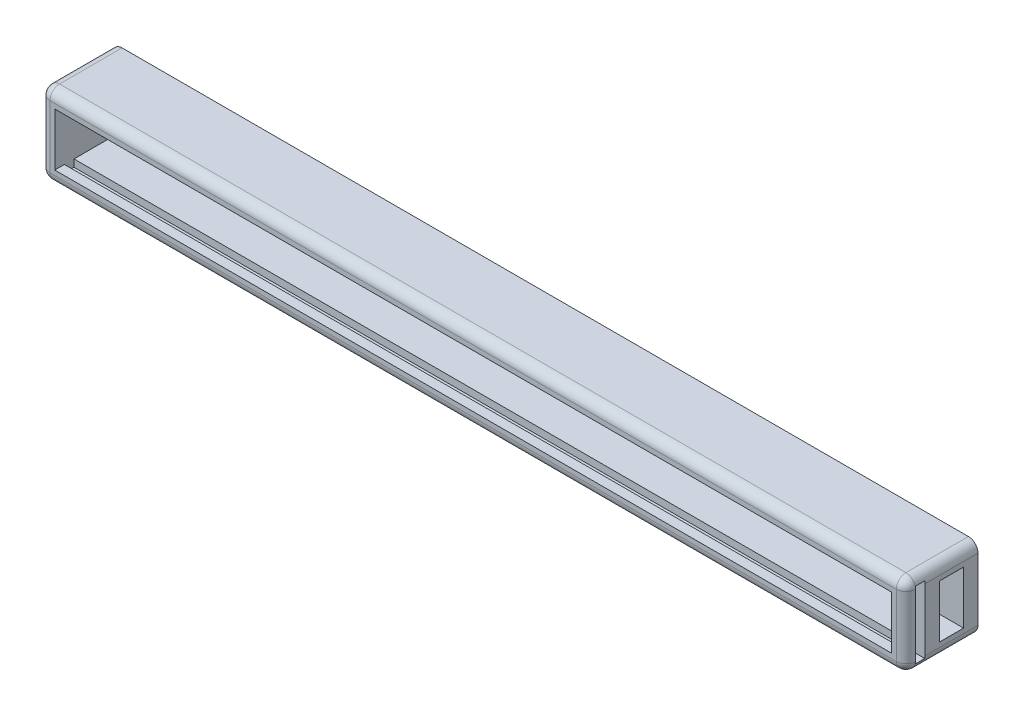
ISO-10303-21;
HEADER;
FILE_DESCRIPTION(('STEP AP214'),'2;1');
FILE_NAME('part.step','',(''),(''),'','','');
FILE_SCHEMA(('AUTOMOTIVE_DESIGN { 1 0 10303 214 1 1 1 1 }'));
ENDSEC;
DATA;
#1=APPLICATION_CONTEXT('core data for automotive mechanical design processes');
#2=APPLICATION_PROTOCOL_DEFINITION('international standard','automotive_design',2000,#1);
#3=PRODUCT_CONTEXT('',#1,'mechanical');
#4=PRODUCT('Part','Part','',(#3));
#5=PRODUCT_RELATED_PRODUCT_CATEGORY('part','',(#4));
#6=PRODUCT_DEFINITION_FORMATION('','',#4);
#7=PRODUCT_DEFINITION_CONTEXT('part definition',#1,'design');
#8=PRODUCT_DEFINITION('design','',#6,#7);
#9=PRODUCT_DEFINITION_SHAPE('','',#8);
#10=(LENGTH_UNIT() NAMED_UNIT(*) SI_UNIT(.MILLI.,.METRE.));
#11=(NAMED_UNIT(*) PLANE_ANGLE_UNIT() SI_UNIT($,.RADIAN.));
#12=(NAMED_UNIT(*) SI_UNIT($,.STERADIAN.) SOLID_ANGLE_UNIT());
#13=UNCERTAINTY_MEASURE_WITH_UNIT(LENGTH_MEASURE(1.E-05),#10,'distance_accuracy_value','');
#14=(GEOMETRIC_REPRESENTATION_CONTEXT(3) GLOBAL_UNCERTAINTY_ASSIGNED_CONTEXT((#13)) GLOBAL_UNIT_ASSIGNED_CONTEXT((#10,
#11,#12)) REPRESENTATION_CONTEXT('',''));
#15=CARTESIAN_POINT('',(0.,0.,0.));
#16=DIRECTION('',(0.,0.,1.));
#17=DIRECTION('',(1.,0.,0.));
#18=AXIS2_PLACEMENT_3D('',#15,#16,#17);
#19=CARTESIAN_POINT('',(90.,-8.49999999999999,15.));
#20=DIRECTION('',(-1.,0.,0.));
#21=DIRECTION('',(0.,0.,1.));
#22=AXIS2_PLACEMENT_3D('',#19,#20,#21);
#23=PLANE('',#22);
#24=DIRECTION('',(0.,0.,1.));
#25=VECTOR('',#24,1.);
#26=CARTESIAN_POINT('',(90.,5.50000000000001,3.));
#27=LINE('',#26,#25);
#28=CARTESIAN_POINT('',(90.,5.50000000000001,3.));
#29=VERTEX_POINT('',#28);
#30=CARTESIAN_POINT('',(90.,5.50000000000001,8.));
#31=VERTEX_POINT('',#30);
#32=EDGE_CURVE('E297',#29,#31,#27,.T.);
#33=ORIENTED_EDGE('',*,*,#32,.F.);
#34=DIRECTION('',(0.,1.,0.));
#35=VECTOR('',#34,1.);
#36=CARTESIAN_POINT('',(90.,-5.49999999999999,3.));
#37=LINE('',#36,#35);
#38=CARTESIAN_POINT('',(90.,-5.49999999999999,3.));
#39=VERTEX_POINT('',#38);
#40=EDGE_CURVE('E293',#39,#29,#37,.T.);
#41=ORIENTED_EDGE('',*,*,#40,.F.);
#42=DIRECTION('',(0.,0.,-1.));
#43=VECTOR('',#42,1.);
#44=CARTESIAN_POINT('',(90.,-5.49999999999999,3.));
#45=LINE('',#44,#43);
#46=CARTESIAN_POINT('',(90.,-5.49999999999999,8.));
#47=VERTEX_POINT('',#46);
#48=EDGE_CURVE('E306',#47,#39,#45,.T.);
#49=ORIENTED_EDGE('',*,*,#48,.F.);
#50=DIRECTION('',(0.,-1.,0.));
#51=VECTOR('',#50,1.);
#52=CARTESIAN_POINT('',(90.,-5.49999999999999,8.));
#53=LINE('',#52,#51);
#54=EDGE_CURVE('E302',#31,#47,#53,.T.);
#55=ORIENTED_EDGE('',*,*,#54,.F.);
#56=EDGE_LOOP('',(#33,#41,#49,#55));
#57=FACE_BOUND('',#56,.T.);
#58=DIRECTION('',(0.,1.,0.));
#59=VECTOR('',#58,1.);
#60=CARTESIAN_POINT('',(90.,6.99999999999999,11.));
#61=LINE('',#60,#59);
#62=CARTESIAN_POINT('',(90.,-6.49999999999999,11.));
#63=VERTEX_POINT('',#62);
#64=CARTESIAN_POINT('',(90.,6.50000000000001,11.));
#65=VERTEX_POINT('',#64);
#66=EDGE_CURVE('E242',#63,#65,#61,.T.);
#67=ORIENTED_EDGE('',*,*,#66,.F.);
#68=DIRECTION('',(0.,0.,-1.));
#69=VECTOR('',#68,1.);
#70=CARTESIAN_POINT('',(90.,-6.49999999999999,15.));
#71=LINE('',#70,#69);
#72=CARTESIAN_POINT('',(90.,-6.49999999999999,0.));
#73=VERTEX_POINT('',#72);
#74=EDGE_CURVE('E56',#63,#73,#71,.T.);
#75=ORIENTED_EDGE('',*,*,#74,.T.);
#76=DIRECTION('',(0.,1.,0.));
#77=VECTOR('',#76,1.);
#78=CARTESIAN_POINT('',(90.,-8.49999999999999,0.));
#79=LINE('',#78,#77);
#80=CARTESIAN_POINT('',(90.,6.50000000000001,0.));
#81=VERTEX_POINT('',#80);
#82=EDGE_CURVE('E358',#73,#81,#79,.T.);
#83=ORIENTED_EDGE('',*,*,#82,.T.);
#84=DIRECTION('',(0.,0.,-1.));
#85=VECTOR('',#84,1.);
#86=CARTESIAN_POINT('',(90.,6.50000000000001,15.));
#87=LINE('',#86,#85);
#88=EDGE_CURVE('E471',#81,#65,#87,.F.);
#89=ORIENTED_EDGE('',*,*,#88,.T.);
#90=EDGE_LOOP('',(#67,#75,#83,#89));
#91=FACE_BOUND('',#90,.T.);
#92=ADVANCED_FACE('F47',(#57,#91),#23,.F.);
#93=CARTESIAN_POINT('',(-87.,-5.49999999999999,24.));
#94=DIRECTION('',(0.,1.,0.));
#95=DIRECTION('',(0.,0.,1.));
#96=AXIS2_PLACEMENT_3D('',#93,#94,#95);
#97=PLANE('',#96);
#98=DIRECTION('',(0.,0.,-1.));
#99=VECTOR('',#98,1.);
#100=CARTESIAN_POINT('',(-87.,-5.49999999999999,24.));
#101=LINE('',#100,#99);
#102=CARTESIAN_POINT('',(-87.,-5.49999999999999,11.));
#103=VERTEX_POINT('',#102);
#104=CARTESIAN_POINT('',(-87.,-5.49999999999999,3.));
#105=VERTEX_POINT('',#104);
#106=EDGE_CURVE('E346',#103,#105,#101,.T.);
#107=ORIENTED_EDGE('',*,*,#106,.F.);
#108=DIRECTION('',(1.,0.,0.));
#109=VECTOR('',#108,1.);
#110=CARTESIAN_POINT('',(-87.,-5.49999999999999,11.));
#111=LINE('',#110,#109);
#112=CARTESIAN_POINT('',(87.,-5.49999999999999,11.));
#113=VERTEX_POINT('',#112);
#114=EDGE_CURVE('E221',#103,#113,#111,.T.);
#115=ORIENTED_EDGE('',*,*,#114,.T.);
#116=DIRECTION('',(0.,0.,-1.));
#117=VECTOR('',#116,1.);
#118=CARTESIAN_POINT('',(87.,-5.49999999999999,24.));
#119=LINE('',#118,#117);
#120=CARTESIAN_POINT('',(87.,-5.49999999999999,8.));
#121=VERTEX_POINT('',#120);
#122=EDGE_CURVE('E341',#113,#121,#119,.T.);
#123=ORIENTED_EDGE('',*,*,#122,.T.);
#124=DIRECTION('',(1.,0.,0.));
#125=VECTOR('',#124,1.);
#126=CARTESIAN_POINT('',(78.,-5.49999999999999,8.));
#127=LINE('',#126,#125);
#128=EDGE_CURVE('E311',#121,#47,#127,.T.);
#129=ORIENTED_EDGE('',*,*,#128,.T.);
#130=ORIENTED_EDGE('',*,*,#48,.T.);
#131=DIRECTION('',(1.,0.,0.));
#132=VECTOR('',#131,1.);
#133=CARTESIAN_POINT('',(-87.,-5.49999999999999,3.));
#134=LINE('',#133,#132);
#135=EDGE_CURVE('E324',#105,#39,#134,.T.);
#136=ORIENTED_EDGE('',*,*,#135,.F.);
#137=EDGE_LOOP('',(#107,#115,#123,#129,#130,#136));
#138=FACE_BOUND('',#137,.T.);
#139=ADVANCED_FACE('F557',(#138),#97,.T.);
#140=CARTESIAN_POINT('',(87.,5.49999999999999,24.));
#141=DIRECTION('',(-1.,0.,0.));
#142=DIRECTION('',(0.,-1.,0.));
#143=AXIS2_PLACEMENT_3D('',#140,#141,#142);
#144=PLANE('',#143);
#145=ORIENTED_EDGE('',*,*,#122,.F.);
#146=DIRECTION('',(0.,1.,0.));
#147=VECTOR('',#146,1.);
#148=CARTESIAN_POINT('',(87.,5.49999999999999,11.));
#149=LINE('',#148,#147);
#150=CARTESIAN_POINT('',(87.,5.49999999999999,11.));
#151=VERTEX_POINT('',#150);
#152=EDGE_CURVE('E284',#113,#151,#149,.T.);
#153=ORIENTED_EDGE('',*,*,#152,.T.);
#154=DIRECTION('',(0.,0.,-1.));
#155=VECTOR('',#154,1.);
#156=CARTESIAN_POINT('',(87.,5.49999999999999,24.));
#157=LINE('',#156,#155);
#158=CARTESIAN_POINT('',(87.,5.49999999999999,8.));
#159=VERTEX_POINT('',#158);
#160=EDGE_CURVE('E336',#151,#159,#157,.T.);
#161=ORIENTED_EDGE('',*,*,#160,.T.);
#162=DIRECTION('',(0.,1.,0.));
#163=VECTOR('',#162,1.);
#164=CARTESIAN_POINT('',(87.,5.49999999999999,8.));
#165=LINE('',#164,#163);
#166=EDGE_CURVE('E314',#121,#159,#165,.T.);
#167=ORIENTED_EDGE('',*,*,#166,.F.);
#168=EDGE_LOOP('',(#145,#153,#161,#167));
#169=FACE_BOUND('',#168,.T.);
#170=ADVANCED_FACE('F574',(#169),#144,.T.);
#171=CARTESIAN_POINT('',(-87.,5.49999999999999,24.));
#172=DIRECTION('',(0.,-1.,0.));
#173=DIRECTION('',(0.,0.,-1.));
#174=AXIS2_PLACEMENT_3D('',#171,#172,#173);
#175=PLANE('',#174);
#176=ORIENTED_EDGE('',*,*,#160,.F.);
#177=DIRECTION('',(-1.,0.,0.));
#178=VECTOR('',#177,1.);
#179=CARTESIAN_POINT('',(-87.,5.49999999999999,11.));
#180=LINE('',#179,#178);
#181=CARTESIAN_POINT('',(-87.,5.49999999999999,11.));
#182=VERTEX_POINT('',#181);
#183=EDGE_CURVE('E281',#151,#182,#180,.T.);
#184=ORIENTED_EDGE('',*,*,#183,.T.);
#185=DIRECTION('',(0.,0.,-1.));
#186=VECTOR('',#185,1.);
#187=CARTESIAN_POINT('',(-87.,5.49999999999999,24.));
#188=LINE('',#187,#186);
#189=CARTESIAN_POINT('',(-87.,5.49999999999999,3.));
#190=VERTEX_POINT('',#189);
#191=EDGE_CURVE('E331',#182,#190,#188,.T.);
#192=ORIENTED_EDGE('',*,*,#191,.T.);
#193=DIRECTION('',(-1.,0.,0.));
#194=VECTOR('',#193,1.);
#195=CARTESIAN_POINT('',(-87.,5.49999999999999,3.));
#196=LINE('',#195,#194);
#197=EDGE_CURVE('E327',#29,#190,#196,.T.);
#198=ORIENTED_EDGE('',*,*,#197,.F.);
#199=ORIENTED_EDGE('',*,*,#32,.T.);
#200=DIRECTION('',(1.,0.,0.));
#201=VECTOR('',#200,1.);
#202=CARTESIAN_POINT('',(78.,5.50000000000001,8.));
#203=LINE('',#202,#201);
#204=EDGE_CURVE('E310',#159,#31,#203,.T.);
#205=ORIENTED_EDGE('',*,*,#204,.F.);
#206=EDGE_LOOP('',(#176,#184,#192,#198,#199,#205));
#207=FACE_BOUND('',#206,.T.);
#208=ADVANCED_FACE('F564',(#207),#175,.T.);
#209=CARTESIAN_POINT('',(88.,-6.49999999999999,15.));
#210=DIRECTION('',(0.,0.,-1.));
#211=DIRECTION('',(-1.,0.,0.));
#212=AXIS2_PLACEMENT_3D('',#209,#210,#211);
#213=CYLINDRICAL_SURFACE('',#212,2.);
#214=CARTESIAN_POINT('',(88.,-6.49999999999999,11.));
#215=DIRECTION('',(0.,0.,1.));
#216=DIRECTION('',(1.,0.,0.));
#217=AXIS2_PLACEMENT_3D('',#214,#215,#216);
#218=CIRCLE('',#217,2.);
#219=CARTESIAN_POINT('',(89.9364916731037,-6.99999999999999,11.));
#220=VERTEX_POINT('',#219);
#221=EDGE_CURVE('E278',#63,#220,#218,.F.);
#222=ORIENTED_EDGE('',*,*,#221,.T.);
#223=DIRECTION('',(0.,0.,-1.));
#224=VECTOR('',#223,1.);
#225=CARTESIAN_POINT('',(89.9364916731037,-6.99999999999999,15.));
#226=LINE('',#225,#224);
#227=CARTESIAN_POINT('',(89.9364916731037,-6.99999999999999,13.));
#228=VERTEX_POINT('',#227);
#229=EDGE_CURVE('E240',#220,#228,#226,.F.);
#230=ORIENTED_EDGE('',*,*,#229,.T.);
#231=CARTESIAN_POINT('',(88.,-6.49999999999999,13.));
#232=DIRECTION('',(0.,0.,1.));
#233=DIRECTION('',(1.,0.,0.));
#234=AXIS2_PLACEMENT_3D('',#231,#232,#233);
#235=CIRCLE('',#234,2.);
#236=CARTESIAN_POINT('',(88.,-8.49999999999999,13.));
#237=VERTEX_POINT('',#236);
#238=EDGE_CURVE('E484',#237,#228,#235,.T.);
#239=ORIENTED_EDGE('',*,*,#238,.F.);
#240=DIRECTION('',(0.,0.,-1.));
#241=VECTOR('',#240,1.);
#242=CARTESIAN_POINT('',(88.,-8.49999999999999,15.));
#243=LINE('',#242,#241);
#244=CARTESIAN_POINT('',(88.,-8.49999999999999,0.));
#245=VERTEX_POINT('',#244);
#246=EDGE_CURVE('E441',#245,#237,#243,.F.);
#247=ORIENTED_EDGE('',*,*,#246,.F.);
#248=CARTESIAN_POINT('',(88.,-6.49999999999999,0.));
#249=DIRECTION('',(0.,0.,1.));
#250=DIRECTION('',(1.,0.,0.));
#251=AXIS2_PLACEMENT_3D('',#248,#249,#250);
#252=CIRCLE('',#251,2.);
#253=EDGE_CURVE('E450',#73,#245,#252,.F.);
#254=ORIENTED_EDGE('',*,*,#253,.F.);
#255=ORIENTED_EDGE('',*,*,#74,.F.);
#256=EDGE_LOOP('',(#222,#230,#239,#247,#254,#255));
#257=FACE_BOUND('',#256,.T.);
#258=ADVANCED_FACE('F537',(#257),#213,.T.);
#259=CARTESIAN_POINT('',(88.,6.50000000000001,15.));
#260=DIRECTION('',(0.,0.,-1.));
#261=DIRECTION('',(-1.,0.,0.));
#262=AXIS2_PLACEMENT_3D('',#259,#260,#261);
#263=CYLINDRICAL_SURFACE('',#262,2.);
#264=CARTESIAN_POINT('',(88.,6.50000000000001,13.));
#265=DIRECTION('',(0.,0.,1.));
#266=DIRECTION('',(1.,0.,0.));
#267=AXIS2_PLACEMENT_3D('',#264,#265,#266);
#268=CIRCLE('',#267,2.);
#269=CARTESIAN_POINT('',(89.9364916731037,6.99999999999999,13.));
#270=VERTEX_POINT('',#269);
#271=CARTESIAN_POINT('',(88.,8.50000000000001,13.));
#272=VERTEX_POINT('',#271);
#273=EDGE_CURVE('E292',#270,#272,#268,.T.);
#274=ORIENTED_EDGE('',*,*,#273,.F.);
#275=DIRECTION('',(0.,0.,-1.));
#276=VECTOR('',#275,1.);
#277=CARTESIAN_POINT('',(89.9364916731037,6.99999999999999,15.));
#278=LINE('',#277,#276);
#279=CARTESIAN_POINT('',(89.9364916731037,6.99999999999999,11.));
#280=VERTEX_POINT('',#279);
#281=EDGE_CURVE('E274',#270,#280,#278,.T.);
#282=ORIENTED_EDGE('',*,*,#281,.T.);
#283=CARTESIAN_POINT('',(88.,6.50000000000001,11.));
#284=DIRECTION('',(0.,0.,1.));
#285=DIRECTION('',(1.,0.,0.));
#286=AXIS2_PLACEMENT_3D('',#283,#284,#285);
#287=CIRCLE('',#286,2.);
#288=EDGE_CURVE('E11',#280,#65,#287,.F.);
#289=ORIENTED_EDGE('',*,*,#288,.T.);
#290=ORIENTED_EDGE('',*,*,#88,.F.);
#291=CARTESIAN_POINT('',(88.,6.50000000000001,0.));
#292=DIRECTION('',(0.,0.,1.));
#293=DIRECTION('',(1.,0.,0.));
#294=AXIS2_PLACEMENT_3D('',#291,#292,#293);
#295=CIRCLE('',#294,2.);
#296=CARTESIAN_POINT('',(88.,8.50000000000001,0.));
#297=VERTEX_POINT('',#296);
#298=EDGE_CURVE('E447',#297,#81,#295,.F.);
#299=ORIENTED_EDGE('',*,*,#298,.F.);
#300=DIRECTION('',(0.,0.,-1.));
#301=VECTOR('',#300,1.);
#302=CARTESIAN_POINT('',(88.,8.50000000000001,15.));
#303=LINE('',#302,#301);
#304=EDGE_CURVE('E465',#272,#297,#303,.T.);
#305=ORIENTED_EDGE('',*,*,#304,.F.);
#306=EDGE_LOOP('',(#274,#282,#289,#290,#299,#305));
#307=FACE_BOUND('',#306,.T.);
#308=ADVANCED_FACE('F49',(#307),#263,.T.);
#309=CARTESIAN_POINT('',(0.,0.,15.));
#310=DIRECTION('',(0.,0.,1.));
#311=DIRECTION('',(1.,0.,0.));
#312=AXIS2_PLACEMENT_3D('',#309,#310,#311);
#313=PLANE('',#312);
#314=DIRECTION('',(0.,1.,0.));
#315=VECTOR('',#314,1.);
#316=CARTESIAN_POINT('',(88.,8.50000000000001,15.));
#317=LINE('',#316,#315);
#318=CARTESIAN_POINT('',(88.,-6.49999999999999,15.));
#319=VERTEX_POINT('',#318);
#320=CARTESIAN_POINT('',(88.,6.50000000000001,15.));
#321=VERTEX_POINT('',#320);
#322=EDGE_CURVE('E374',#319,#321,#317,.T.);
#323=ORIENTED_EDGE('',*,*,#322,.T.);
#324=DIRECTION('',(-1.,0.,0.));
#325=VECTOR('',#324,1.);
#326=CARTESIAN_POINT('',(-90.,6.49999999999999,15.));
#327=LINE('',#326,#325);
#328=CARTESIAN_POINT('',(-88.,6.49999999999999,15.));
#329=VERTEX_POINT('',#328);
#330=EDGE_CURVE('E378',#321,#329,#327,.T.);
#331=ORIENTED_EDGE('',*,*,#330,.T.);
#332=DIRECTION('',(0.,-1.,0.));
#333=VECTOR('',#332,1.);
#334=CARTESIAN_POINT('',(-88.,-8.50000000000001,15.));
#335=LINE('',#334,#333);
#336=CARTESIAN_POINT('',(-88.,-6.50000000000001,15.));
#337=VERTEX_POINT('',#336);
#338=EDGE_CURVE('E366',#329,#337,#335,.T.);
#339=ORIENTED_EDGE('',*,*,#338,.T.);
#340=DIRECTION('',(1.,0.,0.));
#341=VECTOR('',#340,1.);
#342=CARTESIAN_POINT('',(90.,-6.49999999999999,15.));
#343=LINE('',#342,#341);
#344=EDGE_CURVE('E370',#337,#319,#343,.T.);
#345=ORIENTED_EDGE('',*,*,#344,.T.);
#346=EDGE_LOOP('',(#323,#331,#339,#345));
#347=FACE_BOUND('',#346,.T.);
#348=DIRECTION('',(-1.,0.,0.));
#349=VECTOR('',#348,1.);
#350=CARTESIAN_POINT('',(0.,-5.49999999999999,15.));
#351=LINE('',#350,#349);
#352=CARTESIAN_POINT('',(87.,-5.49999999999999,15.));
#353=VERTEX_POINT('',#352);
#354=CARTESIAN_POINT('',(-87.,-5.49999999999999,15.));
#355=VERTEX_POINT('',#354);
#356=EDGE_CURVE('E405',#353,#355,#351,.T.);
#357=ORIENTED_EDGE('',*,*,#356,.T.);
#358=DIRECTION('',(0.,1.,0.));
#359=VECTOR('',#358,1.);
#360=CARTESIAN_POINT('',(-87.,0.,15.));
#361=LINE('',#360,#359);
#362=CARTESIAN_POINT('',(-87.,5.49999999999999,15.));
#363=VERTEX_POINT('',#362);
#364=EDGE_CURVE('E409',#355,#363,#361,.T.);
#365=ORIENTED_EDGE('',*,*,#364,.T.);
#366=DIRECTION('',(1.,0.,0.));
#367=VECTOR('',#366,1.);
#368=CARTESIAN_POINT('',(0.,5.49999999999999,15.));
#369=LINE('',#368,#367);
#370=CARTESIAN_POINT('',(87.,5.49999999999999,15.));
#371=VERTEX_POINT('',#370);
#372=EDGE_CURVE('E397',#363,#371,#369,.T.);
#373=ORIENTED_EDGE('',*,*,#372,.T.);
#374=DIRECTION('',(0.,-1.,0.));
#375=VECTOR('',#374,1.);
#376=CARTESIAN_POINT('',(87.,-2.19521370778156E-13,15.));
#377=LINE('',#376,#375);
#378=EDGE_CURVE('E401',#371,#353,#377,.T.);
#379=ORIENTED_EDGE('',*,*,#378,.T.);
#380=EDGE_LOOP('',(#357,#365,#373,#379));
#381=FACE_BOUND('',#380,.T.);
#382=ADVANCED_FACE('F523',(#347,#381),#313,.T.);
#383=CARTESIAN_POINT('',(-90.,-8.50000000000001,15.));
#384=DIRECTION('',(1.,0.,0.));
#385=DIRECTION('',(0.,1.,0.));
#386=AXIS2_PLACEMENT_3D('',#383,#384,#385);
#387=PLANE('',#386);
#388=DIRECTION('',(0.,-1.,0.));
#389=VECTOR('',#388,1.);
#390=CARTESIAN_POINT('',(-90.,-8.50000000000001,0.));
#391=LINE('',#390,#389);
#392=CARTESIAN_POINT('',(-90.,6.49999999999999,0.));
#393=VERTEX_POINT('',#392);
#394=CARTESIAN_POINT('',(-90.,-6.50000000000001,0.));
#395=VERTEX_POINT('',#394);
#396=EDGE_CURVE('E350',#393,#395,#391,.T.);
#397=ORIENTED_EDGE('',*,*,#396,.T.);
#398=DIRECTION('',(0.,0.,-1.));
#399=VECTOR('',#398,1.);
#400=CARTESIAN_POINT('',(-90.,-6.50000000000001,15.));
#401=LINE('',#400,#399);
#402=CARTESIAN_POINT('',(-90.,-6.50000000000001,13.));
#403=VERTEX_POINT('',#402);
#404=EDGE_CURVE('E462',#395,#403,#401,.F.);
#405=ORIENTED_EDGE('',*,*,#404,.T.);
#406=DIRECTION('',(0.,-1.,0.));
#407=VECTOR('',#406,1.);
#408=CARTESIAN_POINT('',(-90.,8.49999999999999,13.));
#409=LINE('',#408,#407);
#410=CARTESIAN_POINT('',(-90.,6.49999999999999,13.));
#411=VERTEX_POINT('',#410);
#412=EDGE_CURVE('E393',#403,#411,#409,.F.);
#413=ORIENTED_EDGE('',*,*,#412,.T.);
#414=DIRECTION('',(0.,0.,-1.));
#415=VECTOR('',#414,1.);
#416=CARTESIAN_POINT('',(-90.,6.49999999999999,15.));
#417=LINE('',#416,#415);
#418=EDGE_CURVE('E459',#411,#393,#417,.T.);
#419=ORIENTED_EDGE('',*,*,#418,.T.);
#420=EDGE_LOOP('',(#397,#405,#413,#419));
#421=FACE_BOUND('',#420,.T.);
#422=ADVANCED_FACE('F599',(#421),#387,.F.);
#423=CARTESIAN_POINT('',(90.,-8.49999999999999,15.));
#424=DIRECTION('',(0.,1.,0.));
#425=DIRECTION('',(-1.,0.,0.));
#426=AXIS2_PLACEMENT_3D('',#423,#424,#425);
#427=PLANE('',#426);
#428=DIRECTION('',(1.,0.,0.));
#429=VECTOR('',#428,1.);
#430=CARTESIAN_POINT('',(-90.,-8.50000000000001,13.));
#431=LINE('',#430,#429);
#432=CARTESIAN_POINT('',(-88.,-8.50000000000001,13.));
#433=VERTEX_POINT('',#432);
#434=EDGE_CURVE('E389',#237,#433,#431,.F.);
#435=ORIENTED_EDGE('',*,*,#434,.T.);
#436=DIRECTION('',(0.,0.,-1.));
#437=VECTOR('',#436,1.);
#438=CARTESIAN_POINT('',(-88.,-8.50000000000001,15.));
#439=LINE('',#438,#437);
#440=CARTESIAN_POINT('',(-87.9999999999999,-8.50000000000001,0.));
#441=VERTEX_POINT('',#440);
#442=EDGE_CURVE('E444',#433,#441,#439,.T.);
#443=ORIENTED_EDGE('',*,*,#442,.T.);
#444=DIRECTION('',(1.,0.,0.));
#445=VECTOR('',#444,1.);
#446=CARTESIAN_POINT('',(90.,-8.49999999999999,0.));
#447=LINE('',#446,#445);
#448=EDGE_CURVE('E354',#441,#245,#447,.T.);
#449=ORIENTED_EDGE('',*,*,#448,.T.);
#450=ORIENTED_EDGE('',*,*,#246,.T.);
#451=EDGE_LOOP('',(#435,#443,#449,#450));
#452=FACE_BOUND('',#451,.T.);
#453=ADVANCED_FACE('F596',(#452),#427,.F.);
#454=CARTESIAN_POINT('',(90.,8.50000000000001,15.));
#455=DIRECTION('',(0.,-1.,0.));
#456=DIRECTION('',(1.,0.,0.));
#457=AXIS2_PLACEMENT_3D('',#454,#455,#456);
#458=PLANE('',#457);
#459=DIRECTION('',(-1.,0.,0.));
#460=VECTOR('',#459,1.);
#461=CARTESIAN_POINT('',(90.,8.50000000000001,0.));
#462=LINE('',#461,#460);
#463=CARTESIAN_POINT('',(-87.9999999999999,8.49999999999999,0.));
#464=VERTEX_POINT('',#463);
#465=EDGE_CURVE('E362',#297,#464,#462,.T.);
#466=ORIENTED_EDGE('',*,*,#465,.T.);
#467=DIRECTION('',(0.,0.,-1.));
#468=VECTOR('',#467,1.);
#469=CARTESIAN_POINT('',(-88.,8.49999999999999,15.));
#470=LINE('',#469,#468);
#471=CARTESIAN_POINT('',(-88.,8.49999999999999,13.));
#472=VERTEX_POINT('',#471);
#473=EDGE_CURVE('E468',#464,#472,#470,.F.);
#474=ORIENTED_EDGE('',*,*,#473,.T.);
#475=DIRECTION('',(-1.,0.,0.));
#476=VECTOR('',#475,1.);
#477=CARTESIAN_POINT('',(90.,8.50000000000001,13.));
#478=LINE('',#477,#476);
#479=EDGE_CURVE('E382',#472,#272,#478,.F.);
#480=ORIENTED_EDGE('',*,*,#479,.T.);
#481=ORIENTED_EDGE('',*,*,#304,.T.);
#482=EDGE_LOOP('',(#466,#474,#480,#481));
#483=FACE_BOUND('',#482,.T.);
#484=ADVANCED_FACE('F507',(#483),#458,.F.);
#485=CARTESIAN_POINT('',(0.,0.,0.));
#486=DIRECTION('',(0.,0.,1.));
#487=DIRECTION('',(1.,0.,0.));
#488=AXIS2_PLACEMENT_3D('',#485,#486,#487);
#489=PLANE('',#488);
#490=ORIENTED_EDGE('',*,*,#448,.F.);
#491=CARTESIAN_POINT('',(-88.,-6.50000000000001,0.));
#492=DIRECTION('',(0.,0.,1.));
#493=DIRECTION('',(1.,0.,0.));
#494=AXIS2_PLACEMENT_3D('',#491,#492,#493);
#495=CIRCLE('',#494,2.);
#496=EDGE_CURVE('E456',#441,#395,#495,.F.);
#497=ORIENTED_EDGE('',*,*,#496,.T.);
#498=ORIENTED_EDGE('',*,*,#396,.F.);
#499=CARTESIAN_POINT('',(-88.,6.49999999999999,0.));
#500=DIRECTION('',(0.,0.,1.));
#501=DIRECTION('',(1.,0.,0.));
#502=AXIS2_PLACEMENT_3D('',#499,#500,#501);
#503=CIRCLE('',#502,2.);
#504=EDGE_CURVE('E453',#393,#464,#503,.F.);
#505=ORIENTED_EDGE('',*,*,#504,.T.);
#506=ORIENTED_EDGE('',*,*,#465,.F.);
#507=ORIENTED_EDGE('',*,*,#298,.T.);
#508=ORIENTED_EDGE('',*,*,#82,.F.);
#509=ORIENTED_EDGE('',*,*,#253,.T.);
#510=EDGE_LOOP('',(#490,#497,#498,#505,#506,#507,#508,#509));
#511=FACE_BOUND('',#510,.T.);
#512=ADVANCED_FACE('F613',(#511),#489,.F.);
#513=CARTESIAN_POINT('',(0.,-6.5,13.));
#514=DIRECTION('',(-1.,0.,0.));
#515=DIRECTION('',(0.,-1.,0.));
#516=AXIS2_PLACEMENT_3D('',#513,#514,#515);
#517=CYLINDRICAL_SURFACE('',#516,2.);
#518=ORIENTED_EDGE('',*,*,#344,.F.);
#519=CARTESIAN_POINT('',(-88.,-6.50000000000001,13.));
#520=DIRECTION('',(-1.,0.,0.));
#521=DIRECTION('',(0.,-1.,0.));
#522=AXIS2_PLACEMENT_3D('',#519,#520,#521);
#523=CIRCLE('',#522,2.);
#524=EDGE_CURVE('E423',#337,#433,#523,.F.);
#525=ORIENTED_EDGE('',*,*,#524,.T.);
#526=ORIENTED_EDGE('',*,*,#434,.F.);
#527=CARTESIAN_POINT('',(88.,-6.49999999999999,13.));
#528=DIRECTION('',(-1.,0.,0.));
#529=DIRECTION('',(0.,-1.,0.));
#530=AXIS2_PLACEMENT_3D('',#527,#528,#529);
#531=CIRCLE('',#530,2.);
#532=EDGE_CURVE('E420',#237,#319,#531,.T.);
#533=ORIENTED_EDGE('',*,*,#532,.T.);
#534=EDGE_LOOP('',(#518,#525,#526,#533));
#535=FACE_BOUND('',#534,.T.);
#536=ADVANCED_FACE('F610',(#535),#517,.T.);
#537=CARTESIAN_POINT('',(88.,0.,13.));
#538=DIRECTION('',(0.,-1.,0.));
#539=DIRECTION('',(0.,0.,-1.));
#540=AXIS2_PLACEMENT_3D('',#537,#538,#539);
#541=CYLINDRICAL_SURFACE('',#540,2.);
#542=ORIENTED_EDGE('',*,*,#322,.F.);
#543=CARTESIAN_POINT('',(88.,-6.49999999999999,13.));
#544=DIRECTION('',(0.,-1.,0.));
#545=DIRECTION('',(0.,0.,-1.));
#546=AXIS2_PLACEMENT_3D('',#543,#544,#545);
#547=CIRCLE('',#546,2.);
#548=CARTESIAN_POINT('',(90.,-6.49999999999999,13.));
#549=VERTEX_POINT('',#548);
#550=EDGE_CURVE('E437',#319,#549,#547,.F.);
#551=ORIENTED_EDGE('',*,*,#550,.T.);
#552=DIRECTION('',(0.,1.,0.));
#553=VECTOR('',#552,1.);
#554=CARTESIAN_POINT('',(90.,-8.49999999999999,13.));
#555=LINE('',#554,#553);
#556=CARTESIAN_POINT('',(90.,6.50000000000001,13.));
#557=VERTEX_POINT('',#556);
#558=EDGE_CURVE('E386',#557,#549,#555,.F.);
#559=ORIENTED_EDGE('',*,*,#558,.F.);
#560=CARTESIAN_POINT('',(88.,6.50000000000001,13.));
#561=DIRECTION('',(0.,-1.,0.));
#562=DIRECTION('',(0.,0.,-1.));
#563=AXIS2_PLACEMENT_3D('',#560,#561,#562);
#564=CIRCLE('',#563,2.);
#565=EDGE_CURVE('E434',#557,#321,#564,.T.);
#566=ORIENTED_EDGE('',*,*,#565,.T.);
#567=EDGE_LOOP('',(#542,#551,#559,#566));
#568=FACE_BOUND('',#567,.T.);
#569=ADVANCED_FACE('F528',(#568),#541,.T.);
#570=CARTESIAN_POINT('',(-88.,0.,13.));
#571=DIRECTION('',(0.,1.,0.));
#572=DIRECTION('',(-1.,0.,0.));
#573=AXIS2_PLACEMENT_3D('',#570,#571,#572);
#574=CYLINDRICAL_SURFACE('',#573,2.);
#575=ORIENTED_EDGE('',*,*,#412,.F.);
#576=CARTESIAN_POINT('',(-88.,-6.50000000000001,13.));
#577=DIRECTION('',(0.,1.,0.));
#578=DIRECTION('',(-1.,0.,0.));
#579=AXIS2_PLACEMENT_3D('',#576,#577,#578);
#580=CIRCLE('',#579,2.);
#581=EDGE_CURVE('E416',#403,#337,#580,.T.);
#582=ORIENTED_EDGE('',*,*,#581,.T.);
#583=ORIENTED_EDGE('',*,*,#338,.F.);
#584=CARTESIAN_POINT('',(-88.,6.49999999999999,13.));
#585=DIRECTION('',(0.,1.,0.));
#586=DIRECTION('',(-1.,0.,0.));
#587=AXIS2_PLACEMENT_3D('',#584,#585,#586);
#588=CIRCLE('',#587,2.);
#589=EDGE_CURVE('E413',#329,#411,#588,.F.);
#590=ORIENTED_EDGE('',*,*,#589,.T.);
#591=EDGE_LOOP('',(#575,#582,#583,#590));
#592=FACE_BOUND('',#591,.T.);
#593=ADVANCED_FACE('F519',(#592),#574,.T.);
#594=CARTESIAN_POINT('',(0.,6.5,13.));
#595=DIRECTION('',(1.,0.,0.));
#596=DIRECTION('',(0.,1.,0.));
#597=AXIS2_PLACEMENT_3D('',#594,#595,#596);
#598=CYLINDRICAL_SURFACE('',#597,2.);
#599=ORIENTED_EDGE('',*,*,#479,.F.);
#600=CARTESIAN_POINT('',(-88.,6.49999999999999,13.));
#601=DIRECTION('',(1.,0.,0.));
#602=DIRECTION('',(0.,1.,0.));
#603=AXIS2_PLACEMENT_3D('',#600,#601,#602);
#604=CIRCLE('',#603,2.);
#605=EDGE_CURVE('E430',#472,#329,#604,.T.);
#606=ORIENTED_EDGE('',*,*,#605,.T.);
#607=ORIENTED_EDGE('',*,*,#330,.F.);
#608=CARTESIAN_POINT('',(88.,6.50000000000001,13.));
#609=DIRECTION('',(1.,0.,0.));
#610=DIRECTION('',(0.,1.,0.));
#611=AXIS2_PLACEMENT_3D('',#608,#609,#610);
#612=CIRCLE('',#611,2.);
#613=EDGE_CURVE('E426',#321,#272,#612,.F.);
#614=ORIENTED_EDGE('',*,*,#613,.T.);
#615=EDGE_LOOP('',(#599,#606,#607,#614));
#616=FACE_BOUND('',#615,.T.);
#617=ADVANCED_FACE('F505',(#616),#598,.T.);
#618=CARTESIAN_POINT('',(-87.,5.49999999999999,24.));
#619=DIRECTION('',(1.,0.,0.));
#620=DIRECTION('',(0.,0.,-1.));
#621=AXIS2_PLACEMENT_3D('',#618,#619,#620);
#622=PLANE('',#621);
#623=CARTESIAN_POINT('',(-87.,-5.49999999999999,13.));
#624=VERTEX_POINT('',#623);
#625=EDGE_CURVE('E347',#355,#624,#101,.T.);
#626=ORIENTED_EDGE('',*,*,#625,.T.);
#627=DIRECTION('',(0.,-1.,0.));
#628=VECTOR('',#627,1.);
#629=CARTESIAN_POINT('',(-87.,6.99999999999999,13.));
#630=LINE('',#629,#628);
#631=CARTESIAN_POINT('',(-87.,-6.99999999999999,13.));
#632=VERTEX_POINT('',#631);
#633=EDGE_CURVE('E230',#624,#632,#630,.T.);
#634=ORIENTED_EDGE('',*,*,#633,.T.);
#635=DIRECTION('',(0.,0.,-1.));
#636=VECTOR('',#635,1.);
#637=CARTESIAN_POINT('',(-87.,-6.99999999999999,13.));
#638=LINE('',#637,#636);
#639=CARTESIAN_POINT('',(-87.,-6.99999999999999,11.));
#640=VERTEX_POINT('',#639);
#641=EDGE_CURVE('E227',#632,#640,#638,.T.);
#642=ORIENTED_EDGE('',*,*,#641,.T.);
#643=DIRECTION('',(0.,-1.,0.));
#644=VECTOR('',#643,1.);
#645=CARTESIAN_POINT('',(-87.,6.99999999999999,11.));
#646=LINE('',#645,#644);
#647=EDGE_CURVE('E214',#103,#640,#646,.T.);
#648=ORIENTED_EDGE('',*,*,#647,.F.);
#649=ORIENTED_EDGE('',*,*,#106,.T.);
#650=DIRECTION('',(0.,-1.,0.));
#651=VECTOR('',#650,1.);
#652=CARTESIAN_POINT('',(-87.,5.49999999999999,3.));
#653=LINE('',#652,#651);
#654=EDGE_CURVE('E320',#190,#105,#653,.T.);
#655=ORIENTED_EDGE('',*,*,#654,.F.);
#656=ORIENTED_EDGE('',*,*,#191,.F.);
#657=CARTESIAN_POINT('',(-87.,6.99999999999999,11.));
#658=VERTEX_POINT('',#657);
#659=EDGE_CURVE('E63',#658,#182,#646,.T.);
#660=ORIENTED_EDGE('',*,*,#659,.F.);
#661=DIRECTION('',(0.,0.,-1.));
#662=VECTOR('',#661,1.);
#663=CARTESIAN_POINT('',(-87.,6.99999999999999,13.));
#664=LINE('',#663,#662);
#665=CARTESIAN_POINT('',(-87.,6.99999999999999,13.));
#666=VERTEX_POINT('',#665);
#667=EDGE_CURVE('E236',#666,#658,#664,.T.);
#668=ORIENTED_EDGE('',*,*,#667,.F.);
#669=CARTESIAN_POINT('',(-87.,5.49999999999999,13.));
#670=VERTEX_POINT('',#669);
#671=EDGE_CURVE('E251',#666,#670,#630,.T.);
#672=ORIENTED_EDGE('',*,*,#671,.T.);
#673=EDGE_CURVE('E332',#363,#670,#188,.T.);
#674=ORIENTED_EDGE('',*,*,#673,.F.);
#675=ORIENTED_EDGE('',*,*,#364,.F.);
#676=EDGE_LOOP('',(#626,#634,#642,#648,#649,#655,#656,#660,#668,#672,#674,#675));
#677=FACE_BOUND('',#676,.T.);
#678=ADVANCED_FACE('F229',(#677),#622,.T.);
#679=DIRECTION('',(1.,0.,0.));
#680=VECTOR('',#679,1.);
#681=CARTESIAN_POINT('',(-87.,-5.49999999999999,13.));
#682=LINE('',#681,#680);
#683=CARTESIAN_POINT('',(87.,-5.49999999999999,13.));
#684=VERTEX_POINT('',#683);
#685=EDGE_CURVE('E271',#624,#684,#682,.T.);
#686=ORIENTED_EDGE('',*,*,#685,.F.);
#687=ORIENTED_EDGE('',*,*,#625,.F.);
#688=ORIENTED_EDGE('',*,*,#356,.F.);
#689=EDGE_CURVE('E342',#353,#684,#119,.T.);
#690=ORIENTED_EDGE('',*,*,#689,.T.);
#691=EDGE_LOOP('',(#686,#687,#688,#690));
#692=FACE_BOUND('',#691,.T.);
#693=ADVANCED_FACE('F585',(#692),#97,.T.);
#694=DIRECTION('',(0.,1.,0.));
#695=VECTOR('',#694,1.);
#696=CARTESIAN_POINT('',(87.,5.49999999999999,13.));
#697=LINE('',#696,#695);
#698=CARTESIAN_POINT('',(87.,5.49999999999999,13.));
#699=VERTEX_POINT('',#698);
#700=EDGE_CURVE('E268',#684,#699,#697,.T.);
#701=ORIENTED_EDGE('',*,*,#700,.F.);
#702=ORIENTED_EDGE('',*,*,#689,.F.);
#703=ORIENTED_EDGE('',*,*,#378,.F.);
#704=EDGE_CURVE('E337',#371,#699,#157,.T.);
#705=ORIENTED_EDGE('',*,*,#704,.T.);
#706=EDGE_LOOP('',(#701,#702,#703,#705));
#707=FACE_BOUND('',#706,.T.);
#708=ADVANCED_FACE('F577',(#707),#144,.T.);
#709=DIRECTION('',(-1.,0.,0.));
#710=VECTOR('',#709,1.);
#711=CARTESIAN_POINT('',(-87.,5.49999999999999,13.));
#712=LINE('',#711,#710);
#713=EDGE_CURVE('E265',#699,#670,#712,.T.);
#714=ORIENTED_EDGE('',*,*,#713,.F.);
#715=ORIENTED_EDGE('',*,*,#704,.F.);
#716=ORIENTED_EDGE('',*,*,#372,.F.);
#717=ORIENTED_EDGE('',*,*,#673,.T.);
#718=EDGE_LOOP('',(#714,#715,#716,#717));
#719=FACE_BOUND('',#718,.T.);
#720=ADVANCED_FACE('F583',(#719),#175,.T.);
#721=CARTESIAN_POINT('',(0.,0.,3.));
#722=DIRECTION('',(0.,0.,1.));
#723=DIRECTION('',(1.,0.,0.));
#724=AXIS2_PLACEMENT_3D('',#721,#722,#723);
#725=PLANE('',#724);
#726=ORIENTED_EDGE('',*,*,#197,.T.);
#727=ORIENTED_EDGE('',*,*,#654,.T.);
#728=ORIENTED_EDGE('',*,*,#135,.T.);
#729=ORIENTED_EDGE('',*,*,#40,.T.);
#730=EDGE_LOOP('',(#726,#727,#728,#729));
#731=FACE_BOUND('',#730,.T.);
#732=ADVANCED_FACE('F561',(#731),#725,.T.);
#733=CARTESIAN_POINT('',(78.,-5.49999999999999,8.));
#734=DIRECTION('',(0.,0.,1.));
#735=DIRECTION('',(1.,0.,0.));
#736=AXIS2_PLACEMENT_3D('',#733,#734,#735);
#737=PLANE('',#736);
#738=ORIENTED_EDGE('',*,*,#166,.T.);
#739=ORIENTED_EDGE('',*,*,#204,.T.);
#740=ORIENTED_EDGE('',*,*,#54,.T.);
#741=ORIENTED_EDGE('',*,*,#128,.F.);
#742=EDGE_LOOP('',(#738,#739,#740,#741));
#743=FACE_BOUND('',#742,.T.);
#744=ADVANCED_FACE('F570',(#743),#737,.F.);
#745=CARTESIAN_POINT('',(-88.,-6.50000000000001,15.));
#746=DIRECTION('',(0.,0.,-1.));
#747=DIRECTION('',(-1.,0.,0.));
#748=AXIS2_PLACEMENT_3D('',#745,#746,#747);
#749=CYLINDRICAL_SURFACE('',#748,2.);
#750=ORIENTED_EDGE('',*,*,#496,.F.);
#751=ORIENTED_EDGE('',*,*,#442,.F.);
#752=CARTESIAN_POINT('',(-88.,-6.50000000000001,13.));
#753=DIRECTION('',(0.,0.,1.));
#754=DIRECTION('',(1.,0.,0.));
#755=AXIS2_PLACEMENT_3D('',#752,#753,#754);
#756=CIRCLE('',#755,2.);
#757=EDGE_CURVE('E298',#403,#433,#756,.T.);
#758=ORIENTED_EDGE('',*,*,#757,.F.);
#759=ORIENTED_EDGE('',*,*,#404,.F.);
#760=EDGE_LOOP('',(#750,#751,#758,#759));
#761=FACE_BOUND('',#760,.T.);
#762=ADVANCED_FACE('F618',(#761),#749,.T.);
#763=CARTESIAN_POINT('',(-88.,-6.50000000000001,13.));
#764=DIRECTION('',(0.,0.,1.));
#765=DIRECTION('',(1.,0.,0.));
#766=AXIS2_PLACEMENT_3D('',#763,#764,#765);
#767=SPHERICAL_SURFACE('',#766,2.);
#768=ORIENTED_EDGE('',*,*,#757,.T.);
#769=ORIENTED_EDGE('',*,*,#524,.F.);
#770=ORIENTED_EDGE('',*,*,#581,.F.);
#771=EDGE_LOOP('',(#768,#769,#770));
#772=FACE_BOUND('',#771,.T.);
#773=ADVANCED_FACE('F615',(#772),#767,.T.);
#774=CARTESIAN_POINT('',(-88.,6.49999999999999,15.));
#775=DIRECTION('',(0.,0.,-1.));
#776=DIRECTION('',(-1.,0.,0.));
#777=AXIS2_PLACEMENT_3D('',#774,#775,#776);
#778=CYLINDRICAL_SURFACE('',#777,2.);
#779=ORIENTED_EDGE('',*,*,#504,.F.);
#780=ORIENTED_EDGE('',*,*,#418,.F.);
#781=CARTESIAN_POINT('',(-88.,6.49999999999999,13.));
#782=DIRECTION('',(0.,0.,1.));
#783=DIRECTION('',(1.,0.,0.));
#784=AXIS2_PLACEMENT_3D('',#781,#782,#783);
#785=CIRCLE('',#784,2.);
#786=EDGE_CURVE('E480',#472,#411,#785,.T.);
#787=ORIENTED_EDGE('',*,*,#786,.F.);
#788=ORIENTED_EDGE('',*,*,#473,.F.);
#789=EDGE_LOOP('',(#779,#780,#787,#788));
#790=FACE_BOUND('',#789,.T.);
#791=ADVANCED_FACE('F511',(#790),#778,.T.);
#792=CARTESIAN_POINT('',(-88.,6.49999999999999,13.));
#793=DIRECTION('',(0.,0.,1.));
#794=DIRECTION('',(1.,0.,0.));
#795=AXIS2_PLACEMENT_3D('',#792,#793,#794);
#796=SPHERICAL_SURFACE('',#795,2.);
#797=ORIENTED_EDGE('',*,*,#786,.T.);
#798=ORIENTED_EDGE('',*,*,#589,.F.);
#799=ORIENTED_EDGE('',*,*,#605,.F.);
#800=EDGE_LOOP('',(#797,#798,#799));
#801=FACE_BOUND('',#800,.T.);
#802=ADVANCED_FACE('F515',(#801),#796,.T.);
#803=CARTESIAN_POINT('',(88.,-6.49999999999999,13.));
#804=DIRECTION('',(0.,0.,1.));
#805=DIRECTION('',(1.,0.,0.));
#806=AXIS2_PLACEMENT_3D('',#803,#804,#805);
#807=SPHERICAL_SURFACE('',#806,2.);
#808=ORIENTED_EDGE('',*,*,#550,.F.);
#809=ORIENTED_EDGE('',*,*,#532,.F.);
#810=ORIENTED_EDGE('',*,*,#238,.T.);
#811=CARTESIAN_POINT('',(88.,-6.49999999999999,13.));
#812=DIRECTION('',(0.,0.,1.));
#813=DIRECTION('',(1.,0.,0.));
#814=AXIS2_PLACEMENT_3D('',#811,#812,#813);
#815=CIRCLE('',#814,2.);
#816=EDGE_CURVE('E235',#549,#228,#815,.F.);
#817=ORIENTED_EDGE('',*,*,#816,.F.);
#818=EDGE_LOOP('',(#808,#809,#810,#817));
#819=FACE_BOUND('',#818,.T.);
#820=ADVANCED_FACE('F533',(#819),#807,.T.);
#821=CARTESIAN_POINT('',(88.,6.50000000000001,13.));
#822=DIRECTION('',(0.,0.,1.));
#823=DIRECTION('',(1.,0.,0.));
#824=AXIS2_PLACEMENT_3D('',#821,#822,#823);
#825=SPHERICAL_SURFACE('',#824,2.);
#826=ORIENTED_EDGE('',*,*,#613,.F.);
#827=ORIENTED_EDGE('',*,*,#565,.F.);
#828=EDGE_CURVE('E487',#557,#270,#268,.T.);
#829=ORIENTED_EDGE('',*,*,#828,.T.);
#830=ORIENTED_EDGE('',*,*,#273,.T.);
#831=EDGE_LOOP('',(#826,#827,#829,#830));
#832=FACE_BOUND('',#831,.T.);
#833=ADVANCED_FACE('F496',(#832),#825,.T.);
#834=CARTESIAN_POINT('',(-87.,-6.99999999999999,13.));
#835=DIRECTION('',(0.,1.,0.));
#836=DIRECTION('',(0.,0.,1.));
#837=AXIS2_PLACEMENT_3D('',#834,#835,#836);
#838=PLANE('',#837);
#839=DIRECTION('',(1.,0.,0.));
#840=VECTOR('',#839,1.);
#841=CARTESIAN_POINT('',(-87.,-6.99999999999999,11.));
#842=LINE('',#841,#840);
#843=EDGE_CURVE('E218',#640,#220,#842,.T.);
#844=ORIENTED_EDGE('',*,*,#843,.F.);
#845=ORIENTED_EDGE('',*,*,#641,.F.);
#846=DIRECTION('',(1.,0.,0.));
#847=VECTOR('',#846,1.);
#848=CARTESIAN_POINT('',(-87.,-6.99999999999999,13.));
#849=LINE('',#848,#847);
#850=EDGE_CURVE('E255',#632,#228,#849,.T.);
#851=ORIENTED_EDGE('',*,*,#850,.T.);
#852=ORIENTED_EDGE('',*,*,#229,.F.);
#853=EDGE_LOOP('',(#844,#845,#851,#852));
#854=FACE_BOUND('',#853,.T.);
#855=ADVANCED_FACE('F238',(#854),#838,.T.);
#856=CARTESIAN_POINT('',(-87.,6.99999999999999,13.));
#857=DIRECTION('',(0.,-1.,0.));
#858=DIRECTION('',(0.,0.,-1.));
#859=AXIS2_PLACEMENT_3D('',#856,#857,#858);
#860=PLANE('',#859);
#861=DIRECTION('',(-1.,0.,0.));
#862=VECTOR('',#861,1.);
#863=CARTESIAN_POINT('',(-87.,6.99999999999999,13.));
#864=LINE('',#863,#862);
#865=EDGE_CURVE('E71',#270,#666,#864,.T.);
#866=ORIENTED_EDGE('',*,*,#865,.T.);
#867=ORIENTED_EDGE('',*,*,#667,.T.);
#868=DIRECTION('',(-1.,0.,0.));
#869=VECTOR('',#868,1.);
#870=CARTESIAN_POINT('',(-87.,6.99999999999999,11.));
#871=LINE('',#870,#869);
#872=EDGE_CURVE('E246',#280,#658,#871,.T.);
#873=ORIENTED_EDGE('',*,*,#872,.F.);
#874=ORIENTED_EDGE('',*,*,#281,.F.);
#875=EDGE_LOOP('',(#866,#867,#873,#874));
#876=FACE_BOUND('',#875,.T.);
#877=ADVANCED_FACE('F546',(#876),#860,.T.);
#878=CARTESIAN_POINT('',(0.,0.,13.));
#879=DIRECTION('',(0.,0.,1.));
#880=DIRECTION('',(1.,0.,0.));
#881=AXIS2_PLACEMENT_3D('',#878,#879,#880);
#882=PLANE('',#881);
#883=ORIENTED_EDGE('',*,*,#685,.T.);
#884=ORIENTED_EDGE('',*,*,#700,.T.);
#885=ORIENTED_EDGE('',*,*,#713,.T.);
#886=ORIENTED_EDGE('',*,*,#671,.F.);
#887=ORIENTED_EDGE('',*,*,#865,.F.);
#888=ORIENTED_EDGE('',*,*,#828,.F.);
#889=ORIENTED_EDGE('',*,*,#558,.T.);
#890=ORIENTED_EDGE('',*,*,#816,.T.);
#891=ORIENTED_EDGE('',*,*,#850,.F.);
#892=ORIENTED_EDGE('',*,*,#633,.F.);
#893=EDGE_LOOP('',(#883,#884,#885,#886,#887,#888,#889,#890,#891,#892));
#894=FACE_BOUND('',#893,.T.);
#895=ADVANCED_FACE('F535',(#894),#882,.F.);
#896=CARTESIAN_POINT('',(0.,0.,11.));
#897=DIRECTION('',(0.,0.,1.));
#898=DIRECTION('',(1.,0.,0.));
#899=AXIS2_PLACEMENT_3D('',#896,#897,#898);
#900=PLANE('',#899);
#901=ORIENTED_EDGE('',*,*,#647,.T.);
#902=ORIENTED_EDGE('',*,*,#843,.T.);
#903=ORIENTED_EDGE('',*,*,#221,.F.);
#904=ORIENTED_EDGE('',*,*,#66,.T.);
#905=ORIENTED_EDGE('',*,*,#288,.F.);
#906=ORIENTED_EDGE('',*,*,#872,.T.);
#907=ORIENTED_EDGE('',*,*,#659,.T.);
#908=ORIENTED_EDGE('',*,*,#183,.F.);
#909=ORIENTED_EDGE('',*,*,#152,.F.);
#910=ORIENTED_EDGE('',*,*,#114,.F.);
#911=EDGE_LOOP('',(#901,#902,#903,#904,#905,#906,#907,#908,#909,#910));
#912=FACE_BOUND('',#911,.T.);
#913=ADVANCED_FACE('F216',(#912),#900,.T.);
#914=CLOSED_SHELL('',(#92,#139,#170,#208,#258,#308,#382,#422,#453,#484,#512,#536,#569,#593,#617,
#678,#693,#708,#720,#732,#744,#762,#773,#791,#802,#820,#833,#855,#877,#895,#913));
#915=MANIFOLD_SOLID_BREP('B2',#914);
#916=ADVANCED_BREP_SHAPE_REPRESENTATION('',(#18,#915),#14);
#917=SHAPE_DEFINITION_REPRESENTATION(#9,#916);
ENDSEC;
END-ISO-10303-21;
